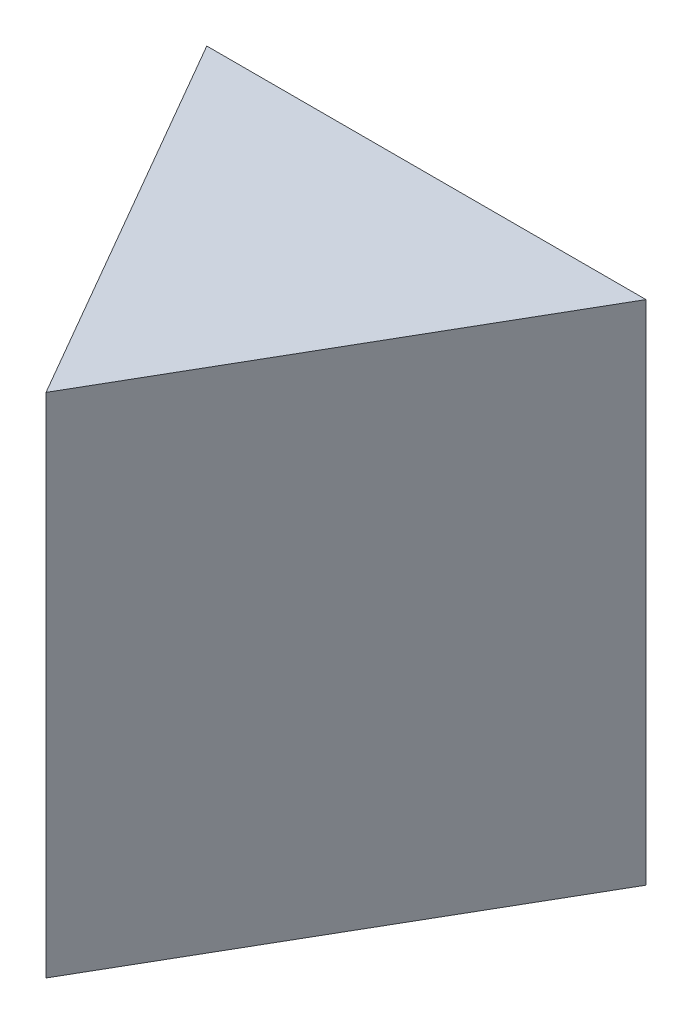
from build123d import *

# Parameters (mm, degrees)
SKIZZE2_R                       = 5
LINEAR_AUSTRAGEN1_DEPTH         = 10
SCHNITT_LINEAR_AUSTRAGEN1_DEPTH = 13.247448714
KREISMUSTER1_COUNT              = 3


with BuildPart() as part:
    # Skizze2 → Linear austragen1 (new body)
    with BuildSketch(Plane(origin=(0, 0, 0), x_dir=(1, 0, 0), z_dir=(0, 1, 0))):
        with Locations(Location((0, 0, 0), (0, 0, 270))):
            Circle(SKIZZE2_R)
    extrude(amount=LINEAR_AUSTRAGEN1_DEPTH)

    # Skizze3 → Schnitt-Linear austragen1 (cut, symmetric)
    with BuildSketch(Plane(origin=(0, 0, 0), x_dir=(1, 0, 0), z_dir=(0, 1, 0))):
        Polygon((-38.271828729, 2.5), (-4.330127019, 2.5), (4.330127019, 2.5), (38.271828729, 2.5), (38.271828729, 70.383403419), (-38.271828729, 70.383403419), align=None)
    schnitt_linear_austragen1 = extrude(amount=SCHNITT_LINEAR_AUSTRAGEN1_DEPTH, both=True, mode=Mode.SUBTRACT)

    # Kreismuster1: Schnitt-Linear austragen1 ×3 about axis
    kreismuster1_axis = Axis((0, 0, 0), (0, 1, 0))
    for i in range(1, KREISMUSTER1_COUNT):
        add(schnitt_linear_austragen1.rotate(kreismuster1_axis, i * 360 / KREISMUSTER1_COUNT), mode=Mode.SUBTRACT)


solid = part.part
